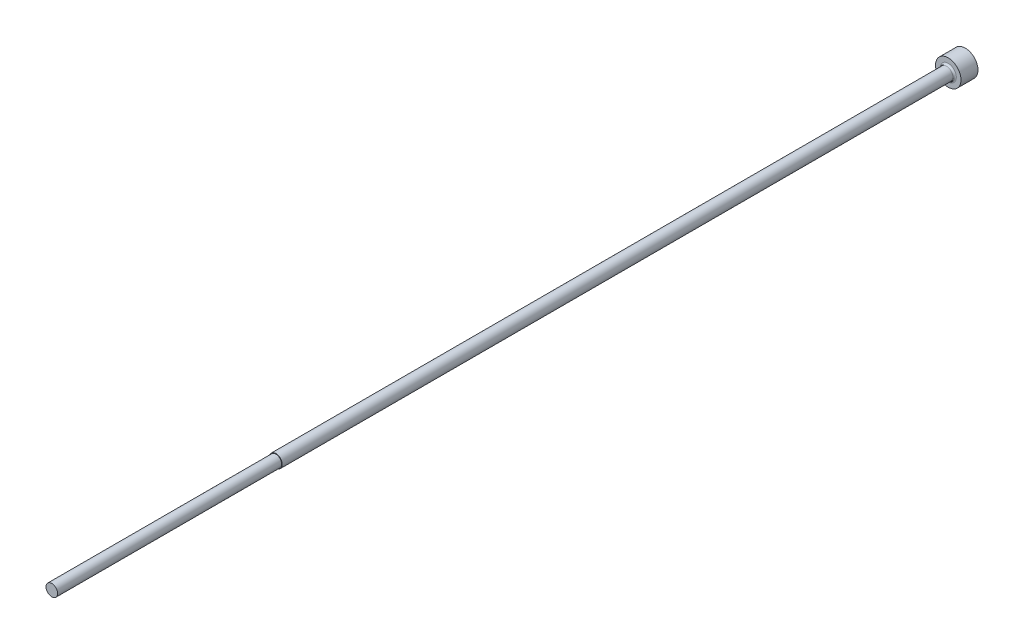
ISO-10303-21;
HEADER;
FILE_DESCRIPTION(('STEP AP214'),'2;1');
FILE_NAME('part.step','',(''),(''),'','','');
FILE_SCHEMA(('AUTOMOTIVE_DESIGN { 1 0 10303 214 1 1 1 1 }'));
ENDSEC;
DATA;
#1=APPLICATION_CONTEXT('core data for automotive mechanical design processes');
#2=APPLICATION_PROTOCOL_DEFINITION('international standard','automotive_design',2000,#1);
#3=PRODUCT_CONTEXT('',#1,'mechanical');
#4=PRODUCT('Part','Part','',(#3));
#5=PRODUCT_RELATED_PRODUCT_CATEGORY('part','',(#4));
#6=PRODUCT_DEFINITION_FORMATION('','',#4);
#7=PRODUCT_DEFINITION_CONTEXT('part definition',#1,'design');
#8=PRODUCT_DEFINITION('design','',#6,#7);
#9=PRODUCT_DEFINITION_SHAPE('','',#8);
#10=(LENGTH_UNIT() NAMED_UNIT(*) SI_UNIT(.MILLI.,.METRE.));
#11=(NAMED_UNIT(*) PLANE_ANGLE_UNIT() SI_UNIT($,.RADIAN.));
#12=(NAMED_UNIT(*) SI_UNIT($,.STERADIAN.) SOLID_ANGLE_UNIT());
#13=UNCERTAINTY_MEASURE_WITH_UNIT(LENGTH_MEASURE(1.E-05),#10,'distance_accuracy_value','');
#14=(GEOMETRIC_REPRESENTATION_CONTEXT(3) GLOBAL_UNCERTAINTY_ASSIGNED_CONTEXT((#13)) GLOBAL_UNIT_ASSIGNED_CONTEXT((#10,
#11,#12)) REPRESENTATION_CONTEXT('',''));
#15=CARTESIAN_POINT('',(0.,0.,0.));
#16=DIRECTION('',(0.,0.,1.));
#17=DIRECTION('',(1.,0.,0.));
#18=AXIS2_PLACEMENT_3D('',#15,#16,#17);
#19=CARTESIAN_POINT('',(0.,0.,2.));
#20=DIRECTION('',(0.,0.,1.));
#21=DIRECTION('',(1.,0.,0.));
#22=AXIS2_PLACEMENT_3D('',#19,#20,#21);
#23=PLANE('',#22);
#24=CARTESIAN_POINT('',(0.,0.,2.));
#25=DIRECTION('',(0.,0.,1.));
#26=DIRECTION('',(1.,0.,0.));
#27=AXIS2_PLACEMENT_3D('',#24,#25,#26);
#28=CIRCLE('',#27,0.95);
#29=CARTESIAN_POINT('',(0.95,0.,2.));
#30=VERTEX_POINT('',#29);
#31=EDGE_CURVE('E11',#30,#30,#28,.F.);
#32=ORIENTED_EDGE('',*,*,#31,.T.);
#33=EDGE_LOOP('',(#32));
#34=FACE_BOUND('',#33,.T.);
#35=CARTESIAN_POINT('',(0.,0.,2.));
#36=DIRECTION('',(0.,0.,1.));
#37=DIRECTION('',(1.,0.,0.));
#38=AXIS2_PLACEMENT_3D('',#35,#36,#37);
#39=CIRCLE('',#38,1.5);
#40=CARTESIAN_POINT('',(1.5,0.,2.));
#41=VERTEX_POINT('',#40);
#42=EDGE_CURVE('E41',#41,#41,#39,.T.);
#43=ORIENTED_EDGE('',*,*,#42,.T.);
#44=EDGE_LOOP('',(#43));
#45=FACE_BOUND('',#44,.T.);
#46=ADVANCED_FACE('F29',(#34,#45),#23,.T.);
#47=CARTESIAN_POINT('',(0.,0.,2.));
#48=DIRECTION('',(0.,0.,-1.));
#49=DIRECTION('',(-1.,0.,0.));
#50=AXIS2_PLACEMENT_3D('',#47,#48,#49);
#51=CYLINDRICAL_SURFACE('',#50,1.5);
#52=ORIENTED_EDGE('',*,*,#42,.F.);
#53=EDGE_LOOP('',(#52));
#54=FACE_BOUND('',#53,.T.);
#55=CARTESIAN_POINT('',(0.,0.,0.));
#56=DIRECTION('',(0.,0.,1.));
#57=DIRECTION('',(1.,0.,0.));
#58=AXIS2_PLACEMENT_3D('',#55,#56,#57);
#59=CIRCLE('',#58,1.5);
#60=CARTESIAN_POINT('',(1.5,0.,0.));
#61=VERTEX_POINT('',#60);
#62=EDGE_CURVE('E46',#61,#61,#59,.T.);
#63=ORIENTED_EDGE('',*,*,#62,.T.);
#64=EDGE_LOOP('',(#63));
#65=FACE_BOUND('',#64,.T.);
#66=ADVANCED_FACE('F31',(#54,#65),#51,.T.);
#67=CARTESIAN_POINT('',(0.,0.,0.));
#68=DIRECTION('',(0.,0.,1.));
#69=DIRECTION('',(1.,0.,0.));
#70=AXIS2_PLACEMENT_3D('',#67,#68,#69);
#71=PLANE('',#70);
#72=ORIENTED_EDGE('',*,*,#62,.F.);
#73=EDGE_LOOP('',(#72));
#74=FACE_BOUND('',#73,.T.);
#75=ADVANCED_FACE('F75',(#74),#71,.F.);
#76=CARTESIAN_POINT('',(0.,0.,322.12132034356));
#77=DIRECTION('',(0.,0.,-1.));
#78=DIRECTION('',(-1.,0.,0.));
#79=AXIS2_PLACEMENT_3D('',#76,#77,#78);
#80=CYLINDRICAL_SURFACE('',#79,0.75);
#81=CARTESIAN_POINT('',(0.,0.,81.12425));
#82=DIRECTION('',(0.,0.,-1.));
#83=DIRECTION('',(-1.,0.,0.));
#84=AXIS2_PLACEMENT_3D('',#81,#82,#83);
#85=CIRCLE('',#84,0.75);
#86=CARTESIAN_POINT('',(-0.75,0.,81.12425));
#87=VERTEX_POINT('',#86);
#88=EDGE_CURVE('E33',#87,#87,#85,.T.);
#89=ORIENTED_EDGE('',*,*,#88,.T.);
#90=EDGE_LOOP('',(#89));
#91=FACE_BOUND('',#90,.T.);
#92=CARTESIAN_POINT('',(0.,0.,2.19999999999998));
#93=DIRECTION('',(0.,0.,1.));
#94=DIRECTION('',(1.,0.,0.));
#95=AXIS2_PLACEMENT_3D('',#92,#93,#94);
#96=CIRCLE('',#95,0.75);
#97=CARTESIAN_POINT('',(0.75,0.,2.19999999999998));
#98=VERTEX_POINT('',#97);
#99=EDGE_CURVE('E37',#98,#98,#96,.T.);
#100=ORIENTED_EDGE('',*,*,#99,.T.);
#101=EDGE_LOOP('',(#100));
#102=FACE_BOUND('',#101,.T.);
#103=ADVANCED_FACE('F72',(#91,#102),#80,.T.);
#104=CARTESIAN_POINT('',(0.,0.,2.19999999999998));
#105=DIRECTION('',(0.,0.,1.));
#106=DIRECTION('',(1.,0.,0.));
#107=AXIS2_PLACEMENT_3D('',#104,#105,#106);
#108=TOROIDAL_SURFACE('',#107,0.95,0.2);
#109=ORIENTED_EDGE('',*,*,#31,.F.);
#110=EDGE_LOOP('',(#109));
#111=FACE_BOUND('',#110,.T.);
#112=ORIENTED_EDGE('',*,*,#99,.F.);
#113=EDGE_LOOP('',(#112));
#114=FACE_BOUND('',#113,.T.);
#115=ADVANCED_FACE('F67',(#111,#114),#108,.F.);
#116=CARTESIAN_POINT('',(5.36335736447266,9.0453123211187,81.12425));
#117=DIRECTION('',(0.,0.,-1.));
#118=DIRECTION('',(-1.,0.,0.));
#119=AXIS2_PLACEMENT_3D('',#116,#117,#118);
#120=PLANE('',#119);
#121=CARTESIAN_POINT('',(0.,0.,81.12425));
#122=DIRECTION('',(0.,0.,-1.));
#123=DIRECTION('',(-1.,0.,0.));
#124=AXIS2_PLACEMENT_3D('',#121,#122,#123);
#125=CIRCLE('',#124,0.684062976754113);
#126=CARTESIAN_POINT('',(-0.684062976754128,0.,81.12425));
#127=VERTEX_POINT('',#126);
#128=EDGE_CURVE('E49',#127,#127,#125,.F.);
#129=ORIENTED_EDGE('',*,*,#128,.F.);
#130=EDGE_LOOP('',(#129));
#131=FACE_BOUND('',#130,.T.);
#132=ORIENTED_EDGE('',*,*,#88,.F.);
#133=EDGE_LOOP('',(#132));
#134=FACE_BOUND('',#133,.T.);
#135=ADVANCED_FACE('F61',(#131,#134),#120,.F.);
#136=CARTESIAN_POINT('',(0.,0.,76.8391829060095));
#137=DIRECTION('',(0.,0.,1.));
#138=DIRECTION('',(1.,0.,0.));
#139=AXIS2_PLACEMENT_3D('',#136,#137,#138);
#140=CYLINDRICAL_SURFACE('',#139,0.684062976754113);
#141=CARTESIAN_POINT('',(0.,0.,107.489875));
#142=DIRECTION('',(0.,0.,1.));
#143=DIRECTION('',(1.,0.,0.));
#144=AXIS2_PLACEMENT_3D('',#141,#142,#143);
#145=CIRCLE('',#144,0.684062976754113);
#146=CARTESIAN_POINT('',(0.684062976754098,0.,107.489875));
#147=VERTEX_POINT('',#146);
#148=EDGE_CURVE('E52',#147,#147,#145,.T.);
#149=ORIENTED_EDGE('',*,*,#148,.F.);
#150=EDGE_LOOP('',(#149));
#151=FACE_BOUND('',#150,.T.);
#152=ORIENTED_EDGE('',*,*,#128,.T.);
#153=EDGE_LOOP('',(#152));
#154=FACE_BOUND('',#153,.T.);
#155=ADVANCED_FACE('F58',(#151,#154),#140,.T.);
#156=CARTESIAN_POINT('',(0.,0.,107.489875));
#157=DIRECTION('',(0.,0.,-1.));
#158=DIRECTION('',(-0.213342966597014,-0.9769773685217,0.));
#159=AXIS2_PLACEMENT_3D('',#156,#157,#158);
#160=PLANE('',#159);
#161=ORIENTED_EDGE('',*,*,#148,.T.);
#162=EDGE_LOOP('',(#161));
#163=FACE_BOUND('',#162,.T.);
#164=ADVANCED_FACE('F56',(#163),#160,.F.);
#165=CLOSED_SHELL('',(#46,#66,#75,#103,#115,#135,#155,#164));
#166=MANIFOLD_SOLID_BREP('B2',#165);
#167=ADVANCED_BREP_SHAPE_REPRESENTATION('',(#18,#166),#14);
#168=SHAPE_DEFINITION_REPRESENTATION(#9,#167);
ENDSEC;
END-ISO-10303-21;
